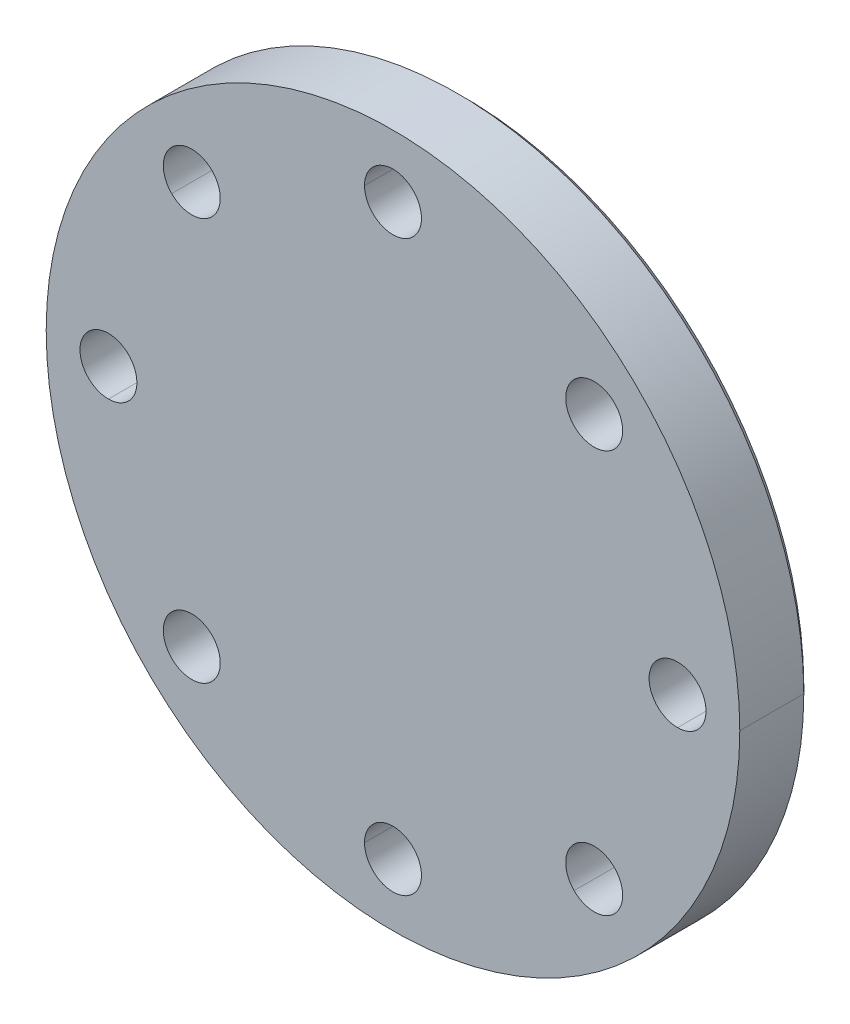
ISO-10303-21;
HEADER;
FILE_DESCRIPTION(('STEP AP214'),'2;1');
FILE_NAME('part.step','',(''),(''),'','','');
FILE_SCHEMA(('AUTOMOTIVE_DESIGN { 1 0 10303 214 1 1 1 1 }'));
ENDSEC;
DATA;
#1=APPLICATION_CONTEXT('core data for automotive mechanical design processes');
#2=APPLICATION_PROTOCOL_DEFINITION('international standard','automotive_design',2000,#1);
#3=PRODUCT_CONTEXT('',#1,'mechanical');
#4=PRODUCT('Part','Part','',(#3));
#5=PRODUCT_RELATED_PRODUCT_CATEGORY('part','',(#4));
#6=PRODUCT_DEFINITION_FORMATION('','',#4);
#7=PRODUCT_DEFINITION_CONTEXT('part definition',#1,'design');
#8=PRODUCT_DEFINITION('design','',#6,#7);
#9=PRODUCT_DEFINITION_SHAPE('','',#8);
#10=(LENGTH_UNIT() NAMED_UNIT(*) SI_UNIT(.MILLI.,.METRE.));
#11=(NAMED_UNIT(*) PLANE_ANGLE_UNIT() SI_UNIT($,.RADIAN.));
#12=(NAMED_UNIT(*) SI_UNIT($,.STERADIAN.) SOLID_ANGLE_UNIT());
#13=UNCERTAINTY_MEASURE_WITH_UNIT(LENGTH_MEASURE(1.E-05),#10,'distance_accuracy_value','');
#14=(GEOMETRIC_REPRESENTATION_CONTEXT(3) GLOBAL_UNCERTAINTY_ASSIGNED_CONTEXT((#13)) GLOBAL_UNIT_ASSIGNED_CONTEXT((#10,
#11,#12)) REPRESENTATION_CONTEXT('',''));
#15=CARTESIAN_POINT('',(0.,0.,0.));
#16=DIRECTION('',(0.,0.,1.));
#17=DIRECTION('',(1.,0.,0.));
#18=AXIS2_PLACEMENT_3D('',#15,#16,#17);
#19=CARTESIAN_POINT('',(3.5,9.45,-17.));
#20=DIRECTION('',(0.,0.,-1.));
#21=DIRECTION('',(-1.,0.,0.));
#22=AXIS2_PLACEMENT_3D('',#19,#20,#21);
#23=PLANE('',#22);
#24=CARTESIAN_POINT('',(0.,0.,-17.));
#25=DIRECTION('',(0.,0.,-1.));
#26=DIRECTION('',(-0.579487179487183,-0.814981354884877,0.));
#27=AXIS2_PLACEMENT_3D('',#24,#25,#26);
#28=CIRCLE('',#27,9.75);
#29=CARTESIAN_POINT('',(9.75,0.,-17.));
#30=VERTEX_POINT('',#29);
#31=CARTESIAN_POINT('',(-9.75,0.,-17.));
#32=VERTEX_POINT('',#31);
#33=EDGE_CURVE('E11',#30,#32,#28,.T.);
#34=ORIENTED_EDGE('',*,*,#33,.F.);
#35=CARTESIAN_POINT('',(0.,0.,-17.));
#36=DIRECTION('',(0.,0.,-1.));
#37=DIRECTION('',(-1.,0.,0.));
#38=AXIS2_PLACEMENT_3D('',#35,#36,#37);
#39=CIRCLE('',#38,9.75);
#40=EDGE_CURVE('E58',#32,#30,#39,.T.);
#41=ORIENTED_EDGE('',*,*,#40,.F.);
#42=EDGE_LOOP('',(#34,#41));
#43=FACE_BOUND('',#42,.T.);
#44=CARTESIAN_POINT('',(0.,8.,-17.));
#45=DIRECTION('',(0.,0.,1.));
#46=DIRECTION('',(1.,0.,0.));
#47=AXIS2_PLACEMENT_3D('',#44,#45,#46);
#48=CIRCLE('',#47,0.8);
#49=CARTESIAN_POINT('',(0.8,8.,-17.));
#50=VERTEX_POINT('',#49);
#51=CARTESIAN_POINT('',(-0.8,8.,-17.));
#52=VERTEX_POINT('',#51);
#53=EDGE_CURVE('E438',#50,#52,#48,.T.);
#54=ORIENTED_EDGE('',*,*,#53,.F.);
#55=CARTESIAN_POINT('',(0.,8.,-17.));
#56=DIRECTION('',(0.,0.,-1.));
#57=DIRECTION('',(1.,0.,0.));
#58=AXIS2_PLACEMENT_3D('',#55,#56,#57);
#59=CIRCLE('',#58,0.8);
#60=EDGE_CURVE('E51',#50,#52,#59,.T.);
#61=ORIENTED_EDGE('',*,*,#60,.T.);
#62=EDGE_LOOP('',(#54,#61));
#63=FACE_BOUND('',#62,.T.);
#64=CARTESIAN_POINT('',(5.656854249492,5.656854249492,-17.));
#65=DIRECTION('',(0.,0.,1.));
#66=DIRECTION('',(0.707106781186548,-0.707106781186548,0.));
#67=AXIS2_PLACEMENT_3D('',#64,#65,#66);
#68=CIRCLE('',#67,0.8);
#69=CARTESIAN_POINT('',(6.222539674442,5.091168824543,-17.));
#70=VERTEX_POINT('',#69);
#71=CARTESIAN_POINT('',(5.091168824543,6.222539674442,-17.));
#72=VERTEX_POINT('',#71);
#73=EDGE_CURVE('E387',#70,#72,#68,.T.);
#74=ORIENTED_EDGE('',*,*,#73,.F.);
#75=CARTESIAN_POINT('',(5.656854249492,5.656854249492,-17.));
#76=DIRECTION('',(0.,0.,-1.));
#77=DIRECTION('',(0.707106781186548,-0.707106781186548,0.));
#78=AXIS2_PLACEMENT_3D('',#75,#76,#77);
#79=CIRCLE('',#78,0.8);
#80=EDGE_CURVE('E428',#70,#72,#79,.T.);
#81=ORIENTED_EDGE('',*,*,#80,.T.);
#82=EDGE_LOOP('',(#74,#81));
#83=FACE_BOUND('',#82,.T.);
#84=CARTESIAN_POINT('',(8.,0.,-17.));
#85=DIRECTION('',(0.,0.,1.));
#86=DIRECTION('',(0.,-1.,0.));
#87=AXIS2_PLACEMENT_3D('',#84,#85,#86);
#88=CIRCLE('',#87,0.8);
#89=CARTESIAN_POINT('',(8.,-0.8,-17.));
#90=VERTEX_POINT('',#89);
#91=CARTESIAN_POINT('',(8.,0.8,-17.));
#92=VERTEX_POINT('',#91);
#93=EDGE_CURVE('E398',#90,#92,#88,.T.);
#94=ORIENTED_EDGE('',*,*,#93,.F.);
#95=CARTESIAN_POINT('',(8.,0.,-17.));
#96=DIRECTION('',(0.,0.,-1.));
#97=DIRECTION('',(0.,-1.,0.));
#98=AXIS2_PLACEMENT_3D('',#95,#96,#97);
#99=CIRCLE('',#98,0.8);
#100=EDGE_CURVE('E426',#90,#92,#99,.T.);
#101=ORIENTED_EDGE('',*,*,#100,.T.);
#102=EDGE_LOOP('',(#94,#101));
#103=FACE_BOUND('',#102,.T.);
#104=CARTESIAN_POINT('',(5.656854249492,-5.656854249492,-17.));
#105=DIRECTION('',(0.,0.,1.));
#106=DIRECTION('',(-0.707106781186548,-0.707106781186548,0.));
#107=AXIS2_PLACEMENT_3D('',#104,#105,#106);
#108=CIRCLE('',#107,0.8);
#109=CARTESIAN_POINT('',(5.091168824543,-6.222539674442,-17.));
#110=VERTEX_POINT('',#109);
#111=CARTESIAN_POINT('',(6.222539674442,-5.091168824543,-17.));
#112=VERTEX_POINT('',#111);
#113=EDGE_CURVE('E381',#110,#112,#108,.T.);
#114=ORIENTED_EDGE('',*,*,#113,.F.);
#115=CARTESIAN_POINT('',(5.656854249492,-5.656854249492,-17.));
#116=DIRECTION('',(0.,0.,-1.));
#117=DIRECTION('',(-0.707106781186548,-0.707106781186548,0.));
#118=AXIS2_PLACEMENT_3D('',#115,#116,#117);
#119=CIRCLE('',#118,0.8);
#120=EDGE_CURVE('E423',#110,#112,#119,.T.);
#121=ORIENTED_EDGE('',*,*,#120,.T.);
#122=EDGE_LOOP('',(#114,#121));
#123=FACE_BOUND('',#122,.T.);
#124=CARTESIAN_POINT('',(0.,-8.,-17.));
#125=DIRECTION('',(0.,0.,1.));
#126=DIRECTION('',(-1.,0.,0.));
#127=AXIS2_PLACEMENT_3D('',#124,#125,#126);
#128=CIRCLE('',#127,0.8);
#129=CARTESIAN_POINT('',(-0.8,-8.,-17.));
#130=VERTEX_POINT('',#129);
#131=CARTESIAN_POINT('',(0.8,-8.,-17.));
#132=VERTEX_POINT('',#131);
#133=EDGE_CURVE('E404',#130,#132,#128,.T.);
#134=ORIENTED_EDGE('',*,*,#133,.F.);
#135=CARTESIAN_POINT('',(0.,-8.,-17.));
#136=DIRECTION('',(0.,0.,-1.));
#137=DIRECTION('',(-1.,0.,0.));
#138=AXIS2_PLACEMENT_3D('',#135,#136,#137);
#139=CIRCLE('',#138,0.8);
#140=EDGE_CURVE('E420',#130,#132,#139,.T.);
#141=ORIENTED_EDGE('',*,*,#140,.T.);
#142=EDGE_LOOP('',(#134,#141));
#143=FACE_BOUND('',#142,.T.);
#144=CARTESIAN_POINT('',(-5.656854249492,-5.656854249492,-17.));
#145=DIRECTION('',(0.,0.,1.));
#146=DIRECTION('',(-0.707106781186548,0.707106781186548,0.));
#147=AXIS2_PLACEMENT_3D('',#144,#145,#146);
#148=CIRCLE('',#147,0.8);
#149=CARTESIAN_POINT('',(-6.222539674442,-5.091168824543,-17.));
#150=VERTEX_POINT('',#149);
#151=CARTESIAN_POINT('',(-5.091168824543,-6.222539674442,-17.));
#152=VERTEX_POINT('',#151);
#153=EDGE_CURVE('E569',#150,#152,#148,.T.);
#154=ORIENTED_EDGE('',*,*,#153,.F.);
#155=CARTESIAN_POINT('',(-5.656854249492,-5.656854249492,-17.));
#156=DIRECTION('',(0.,0.,-1.));
#157=DIRECTION('',(-0.707106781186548,0.707106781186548,0.));
#158=AXIS2_PLACEMENT_3D('',#155,#156,#157);
#159=CIRCLE('',#158,0.8);
#160=EDGE_CURVE('E417',#150,#152,#159,.T.);
#161=ORIENTED_EDGE('',*,*,#160,.T.);
#162=EDGE_LOOP('',(#154,#161));
#163=FACE_BOUND('',#162,.T.);
#164=CARTESIAN_POINT('',(-8.,0.,-17.));
#165=DIRECTION('',(0.,0.,1.));
#166=DIRECTION('',(0.,1.,0.));
#167=AXIS2_PLACEMENT_3D('',#164,#165,#166);
#168=CIRCLE('',#167,0.8);
#169=CARTESIAN_POINT('',(-8.,0.8,-17.));
#170=VERTEX_POINT('',#169);
#171=CARTESIAN_POINT('',(-8.,-0.8,-17.));
#172=VERTEX_POINT('',#171);
#173=EDGE_CURVE('E482',#170,#172,#168,.T.);
#174=ORIENTED_EDGE('',*,*,#173,.F.);
#175=CARTESIAN_POINT('',(-8.,0.,-17.));
#176=DIRECTION('',(0.,0.,-1.));
#177=DIRECTION('',(0.,1.,0.));
#178=AXIS2_PLACEMENT_3D('',#175,#176,#177);
#179=CIRCLE('',#178,0.8);
#180=EDGE_CURVE('E242',#170,#172,#179,.T.);
#181=ORIENTED_EDGE('',*,*,#180,.T.);
#182=EDGE_LOOP('',(#174,#181));
#183=FACE_BOUND('',#182,.T.);
#184=CARTESIAN_POINT('',(-5.656854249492,5.656854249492,-17.));
#185=DIRECTION('',(0.,0.,1.));
#186=DIRECTION('',(0.707106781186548,0.707106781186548,0.));
#187=AXIS2_PLACEMENT_3D('',#184,#185,#186);
#188=CIRCLE('',#187,0.8);
#189=CARTESIAN_POINT('',(-5.091168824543,6.222539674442,-17.));
#190=VERTEX_POINT('',#189);
#191=CARTESIAN_POINT('',(-6.222539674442,5.091168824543,-17.));
#192=VERTEX_POINT('',#191);
#193=EDGE_CURVE('E355',#190,#192,#188,.T.);
#194=ORIENTED_EDGE('',*,*,#193,.F.);
#195=CARTESIAN_POINT('',(-5.656854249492,5.656854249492,-17.));
#196=DIRECTION('',(0.,0.,-1.));
#197=DIRECTION('',(0.707106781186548,0.707106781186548,0.));
#198=AXIS2_PLACEMENT_3D('',#195,#196,#197);
#199=CIRCLE('',#198,0.8);
#200=EDGE_CURVE('E305',#190,#192,#199,.T.);
#201=ORIENTED_EDGE('',*,*,#200,.T.);
#202=EDGE_LOOP('',(#194,#201));
#203=FACE_BOUND('',#202,.T.);
#204=ADVANCED_FACE('F47',(#43,#63,#83,#103,#123,#143,#163,#183,#203),#23,.F.);
#205=CARTESIAN_POINT('',(0.,0.,-18.5));
#206=DIRECTION('',(0.,0.,-1.));
#207=DIRECTION('',(0.,-1.,0.));
#208=AXIS2_PLACEMENT_3D('',#205,#206,#207);
#209=PLANE('',#208);
#210=CARTESIAN_POINT('',(0.,0.,-18.5));
#211=DIRECTION('',(0.,0.,-1.));
#212=DIRECTION('',(1.,0.,0.));
#213=AXIS2_PLACEMENT_3D('',#210,#211,#212);
#214=CIRCLE('',#213,6.1);
#215=CARTESIAN_POINT('',(6.1,0.,-18.5));
#216=VERTEX_POINT('',#215);
#217=CARTESIAN_POINT('',(-6.1,0.,-18.5));
#218=VERTEX_POINT('',#217);
#219=EDGE_CURVE('E489',#216,#218,#214,.T.);
#220=ORIENTED_EDGE('',*,*,#219,.T.);
#221=CARTESIAN_POINT('',(0.,0.,-18.5));
#222=DIRECTION('',(0.,0.,-1.));
#223=DIRECTION('',(-1.,0.,0.));
#224=AXIS2_PLACEMENT_3D('',#221,#222,#223);
#225=CIRCLE('',#224,6.1);
#226=EDGE_CURVE('E375',#218,#216,#225,.T.);
#227=ORIENTED_EDGE('',*,*,#226,.T.);
#228=EDGE_LOOP('',(#220,#227));
#229=FACE_BOUND('',#228,.T.);
#230=ADVANCED_FACE('F646',(#229),#209,.T.);
#231=CARTESIAN_POINT('',(0.,0.,-19.));
#232=DIRECTION('',(0.,0.,-1.));
#233=DIRECTION('',(-1.,0.,0.));
#234=AXIS2_PLACEMENT_3D('',#231,#232,#233);
#235=CYLINDRICAL_SURFACE('',#234,6.1);
#236=DIRECTION('',(0.,0.,1.));
#237=VECTOR('',#236,1.);
#238=CARTESIAN_POINT('',(6.1,0.,-19.));
#239=LINE('',#238,#237);
#240=CARTESIAN_POINT('',(6.1,0.,-19.));
#241=VERTEX_POINT('',#240);
#242=EDGE_CURVE('E370',#241,#216,#239,.T.);
#243=ORIENTED_EDGE('',*,*,#242,.T.);
#244=ORIENTED_EDGE('',*,*,#226,.F.);
#245=DIRECTION('',(0.,0.,1.));
#246=VECTOR('',#245,1.);
#247=CARTESIAN_POINT('',(-6.1,0.,-19.));
#248=LINE('',#247,#246);
#249=CARTESIAN_POINT('',(-6.1,0.,-19.));
#250=VERTEX_POINT('',#249);
#251=EDGE_CURVE('E524',#250,#218,#248,.T.);
#252=ORIENTED_EDGE('',*,*,#251,.F.);
#253=CARTESIAN_POINT('',(0.,0.,-19.));
#254=DIRECTION('',(0.,0.,-1.));
#255=DIRECTION('',(-1.,0.,0.));
#256=AXIS2_PLACEMENT_3D('',#253,#254,#255);
#257=CIRCLE('',#256,6.1);
#258=EDGE_CURVE('E374',#250,#241,#257,.T.);
#259=ORIENTED_EDGE('',*,*,#258,.T.);
#260=EDGE_LOOP('',(#243,#244,#252,#259));
#261=FACE_BOUND('',#260,.T.);
#262=ADVANCED_FACE('F652',(#261),#235,.F.);
#263=CARTESIAN_POINT('',(0.,0.,-19.));
#264=DIRECTION('',(0.,0.,-1.));
#265=DIRECTION('',(-1.,0.,0.));
#266=AXIS2_PLACEMENT_3D('',#263,#264,#265);
#267=CYLINDRICAL_SURFACE('',#266,6.1);
#268=ORIENTED_EDGE('',*,*,#251,.T.);
#269=ORIENTED_EDGE('',*,*,#219,.F.);
#270=ORIENTED_EDGE('',*,*,#242,.F.);
#271=CARTESIAN_POINT('',(0.,0.,-19.));
#272=DIRECTION('',(0.,0.,-1.));
#273=DIRECTION('',(1.,0.,0.));
#274=AXIS2_PLACEMENT_3D('',#271,#272,#273);
#275=CIRCLE('',#274,6.1);
#276=EDGE_CURVE('E481',#241,#250,#275,.T.);
#277=ORIENTED_EDGE('',*,*,#276,.T.);
#278=EDGE_LOOP('',(#268,#269,#270,#277));
#279=FACE_BOUND('',#278,.T.);
#280=ADVANCED_FACE('F715',(#279),#267,.F.);
#281=CARTESIAN_POINT('',(0.,0.,-19.));
#282=DIRECTION('',(0.,0.,-1.));
#283=DIRECTION('',(0.,-1.,0.));
#284=AXIS2_PLACEMENT_3D('',#281,#282,#283);
#285=PLANE('',#284);
#286=ORIENTED_EDGE('',*,*,#276,.F.);
#287=ORIENTED_EDGE('',*,*,#258,.F.);
#288=EDGE_LOOP('',(#286,#287));
#289=FACE_BOUND('',#288,.T.);
#290=CARTESIAN_POINT('',(-5.656854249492,5.656854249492,-19.));
#291=DIRECTION('',(0.,0.,-1.));
#292=DIRECTION('',(-0.707106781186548,-0.707106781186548,0.));
#293=AXIS2_PLACEMENT_3D('',#290,#291,#292);
#294=CIRCLE('',#293,1.1);
#295=CARTESIAN_POINT('',(-6.434671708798,4.879036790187,-19.));
#296=VERTEX_POINT('',#295);
#297=CARTESIAN_POINT('',(-4.879036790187,6.434671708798,-19.));
#298=VERTEX_POINT('',#297);
#299=EDGE_CURVE('E480',#296,#298,#294,.T.);
#300=ORIENTED_EDGE('',*,*,#299,.F.);
#301=CARTESIAN_POINT('',(-5.656854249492,5.656854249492,-19.));
#302=DIRECTION('',(0.,0.,-1.));
#303=DIRECTION('',(0.707106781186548,0.707106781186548,0.));
#304=AXIS2_PLACEMENT_3D('',#301,#302,#303);
#305=CIRCLE('',#304,1.1);
#306=EDGE_CURVE('E477',#298,#296,#305,.T.);
#307=ORIENTED_EDGE('',*,*,#306,.F.);
#308=EDGE_LOOP('',(#300,#307));
#309=FACE_BOUND('',#308,.T.);
#310=CARTESIAN_POINT('',(-8.,0.,-19.));
#311=DIRECTION('',(0.,0.,-1.));
#312=DIRECTION('',(0.,-1.,0.));
#313=AXIS2_PLACEMENT_3D('',#310,#311,#312);
#314=CIRCLE('',#313,1.1);
#315=CARTESIAN_POINT('',(-8.,-1.1,-19.));
#316=VERTEX_POINT('',#315);
#317=CARTESIAN_POINT('',(-8.,1.1,-19.));
#318=VERTEX_POINT('',#317);
#319=EDGE_CURVE('E523',#316,#318,#314,.T.);
#320=ORIENTED_EDGE('',*,*,#319,.F.);
#321=CARTESIAN_POINT('',(-8.,0.,-19.));
#322=DIRECTION('',(0.,0.,-1.));
#323=DIRECTION('',(0.,1.,0.));
#324=AXIS2_PLACEMENT_3D('',#321,#322,#323);
#325=CIRCLE('',#324,1.1);
#326=EDGE_CURVE('E499',#318,#316,#325,.T.);
#327=ORIENTED_EDGE('',*,*,#326,.F.);
#328=EDGE_LOOP('',(#320,#327));
#329=FACE_BOUND('',#328,.T.);
#330=CARTESIAN_POINT('',(-5.656854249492,-5.656854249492,-19.));
#331=DIRECTION('',(0.,0.,-1.));
#332=DIRECTION('',(0.707106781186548,-0.707106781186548,0.));
#333=AXIS2_PLACEMENT_3D('',#330,#331,#332);
#334=CIRCLE('',#333,1.1);
#335=CARTESIAN_POINT('',(-4.879036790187,-6.434671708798,-19.));
#336=VERTEX_POINT('',#335);
#337=CARTESIAN_POINT('',(-6.434671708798,-4.879036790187,-19.));
#338=VERTEX_POINT('',#337);
#339=EDGE_CURVE('E339',#336,#338,#334,.T.);
#340=ORIENTED_EDGE('',*,*,#339,.F.);
#341=CARTESIAN_POINT('',(-5.656854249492,-5.656854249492,-19.));
#342=DIRECTION('',(0.,0.,-1.));
#343=DIRECTION('',(-0.707106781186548,0.707106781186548,0.));
#344=AXIS2_PLACEMENT_3D('',#341,#342,#343);
#345=CIRCLE('',#344,1.1);
#346=EDGE_CURVE('E519',#338,#336,#345,.T.);
#347=ORIENTED_EDGE('',*,*,#346,.F.);
#348=EDGE_LOOP('',(#340,#347));
#349=FACE_BOUND('',#348,.T.);
#350=CARTESIAN_POINT('',(0.,-8.,-19.));
#351=DIRECTION('',(0.,0.,-1.));
#352=DIRECTION('',(1.,0.,0.));
#353=AXIS2_PLACEMENT_3D('',#350,#351,#352);
#354=CIRCLE('',#353,1.1);
#355=CARTESIAN_POINT('',(1.1,-8.,-19.));
#356=VERTEX_POINT('',#355);
#357=CARTESIAN_POINT('',(-1.1,-8.,-19.));
#358=VERTEX_POINT('',#357);
#359=EDGE_CURVE('E323',#356,#358,#354,.T.);
#360=ORIENTED_EDGE('',*,*,#359,.F.);
#361=CARTESIAN_POINT('',(0.,-8.,-19.));
#362=DIRECTION('',(0.,0.,-1.));
#363=DIRECTION('',(-1.,0.,0.));
#364=AXIS2_PLACEMENT_3D('',#361,#362,#363);
#365=CIRCLE('',#364,1.1);
#366=EDGE_CURVE('E334',#358,#356,#365,.T.);
#367=ORIENTED_EDGE('',*,*,#366,.F.);
#368=EDGE_LOOP('',(#360,#367));
#369=FACE_BOUND('',#368,.T.);
#370=CARTESIAN_POINT('',(5.656854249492,-5.656854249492,-19.));
#371=DIRECTION('',(0.,0.,-1.));
#372=DIRECTION('',(0.707106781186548,0.707106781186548,0.));
#373=AXIS2_PLACEMENT_3D('',#370,#371,#372);
#374=CIRCLE('',#373,1.1);
#375=CARTESIAN_POINT('',(6.434671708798,-4.879036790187,-19.));
#376=VERTEX_POINT('',#375);
#377=CARTESIAN_POINT('',(4.879036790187,-6.434671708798,-19.));
#378=VERTEX_POINT('',#377);
#379=EDGE_CURVE('E349',#376,#378,#374,.T.);
#380=ORIENTED_EDGE('',*,*,#379,.F.);
#381=CARTESIAN_POINT('',(5.656854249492,-5.656854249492,-19.));
#382=DIRECTION('',(0.,0.,-1.));
#383=DIRECTION('',(-0.707106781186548,-0.707106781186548,0.));
#384=AXIS2_PLACEMENT_3D('',#381,#382,#383);
#385=CIRCLE('',#384,1.1);
#386=EDGE_CURVE('E344',#378,#376,#385,.T.);
#387=ORIENTED_EDGE('',*,*,#386,.F.);
#388=EDGE_LOOP('',(#380,#387));
#389=FACE_BOUND('',#388,.T.);
#390=CARTESIAN_POINT('',(8.,0.,-19.));
#391=DIRECTION('',(0.,0.,-1.));
#392=DIRECTION('',(0.,1.,0.));
#393=AXIS2_PLACEMENT_3D('',#390,#391,#392);
#394=CIRCLE('',#393,1.1);
#395=CARTESIAN_POINT('',(8.,1.1,-19.));
#396=VERTEX_POINT('',#395);
#397=CARTESIAN_POINT('',(8.,-1.1,-19.));
#398=VERTEX_POINT('',#397);
#399=EDGE_CURVE('E599',#396,#398,#394,.T.);
#400=ORIENTED_EDGE('',*,*,#399,.F.);
#401=CARTESIAN_POINT('',(8.,0.,-19.));
#402=DIRECTION('',(0.,0.,-1.));
#403=DIRECTION('',(0.,-1.,0.));
#404=AXIS2_PLACEMENT_3D('',#401,#402,#403);
#405=CIRCLE('',#404,1.1);
#406=EDGE_CURVE('E603',#398,#396,#405,.T.);
#407=ORIENTED_EDGE('',*,*,#406,.F.);
#408=EDGE_LOOP('',(#400,#407));
#409=FACE_BOUND('',#408,.T.);
#410=CARTESIAN_POINT('',(5.656854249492,5.656854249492,-19.));
#411=DIRECTION('',(0.,0.,-1.));
#412=DIRECTION('',(-0.707106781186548,0.707106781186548,0.));
#413=AXIS2_PLACEMENT_3D('',#410,#411,#412);
#414=CIRCLE('',#413,1.1);
#415=CARTESIAN_POINT('',(4.879036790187,6.434671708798,-19.));
#416=VERTEX_POINT('',#415);
#417=CARTESIAN_POINT('',(6.434671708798,4.879036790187,-19.));
#418=VERTEX_POINT('',#417);
#419=EDGE_CURVE('E549',#416,#418,#414,.T.);
#420=ORIENTED_EDGE('',*,*,#419,.F.);
#421=CARTESIAN_POINT('',(5.656854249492,5.656854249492,-19.));
#422=DIRECTION('',(0.,0.,-1.));
#423=DIRECTION('',(0.707106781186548,-0.707106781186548,0.));
#424=AXIS2_PLACEMENT_3D('',#421,#422,#423);
#425=CIRCLE('',#424,1.1);
#426=EDGE_CURVE('E576',#418,#416,#425,.T.);
#427=ORIENTED_EDGE('',*,*,#426,.F.);
#428=EDGE_LOOP('',(#420,#427));
#429=FACE_BOUND('',#428,.T.);
#430=CARTESIAN_POINT('',(0.,8.,-19.));
#431=DIRECTION('',(0.,0.,-1.));
#432=DIRECTION('',(-1.,0.,0.));
#433=AXIS2_PLACEMENT_3D('',#430,#431,#432);
#434=CIRCLE('',#433,1.1);
#435=CARTESIAN_POINT('',(-1.1,8.,-19.));
#436=VERTEX_POINT('',#435);
#437=CARTESIAN_POINT('',(1.1,8.,-19.));
#438=VERTEX_POINT('',#437);
#439=EDGE_CURVE('E540',#436,#438,#434,.T.);
#440=ORIENTED_EDGE('',*,*,#439,.F.);
#441=CARTESIAN_POINT('',(0.,8.,-19.));
#442=DIRECTION('',(0.,0.,-1.));
#443=DIRECTION('',(1.,0.,0.));
#444=AXIS2_PLACEMENT_3D('',#441,#442,#443);
#445=CIRCLE('',#444,1.1);
#446=EDGE_CURVE('E545',#438,#436,#445,.T.);
#447=ORIENTED_EDGE('',*,*,#446,.F.);
#448=EDGE_LOOP('',(#440,#447));
#449=FACE_BOUND('',#448,.T.);
#450=CARTESIAN_POINT('',(0.,0.,-19.));
#451=DIRECTION('',(0.,0.,-1.));
#452=DIRECTION('',(-1.,0.,0.));
#453=AXIS2_PLACEMENT_3D('',#450,#451,#452);
#454=CIRCLE('',#453,9.55);
#455=CARTESIAN_POINT('',(-9.55,0.,-19.));
#456=VERTEX_POINT('',#455);
#457=CARTESIAN_POINT('',(9.55,0.,-19.));
#458=VERTEX_POINT('',#457);
#459=EDGE_CURVE('E544',#456,#458,#454,.T.);
#460=ORIENTED_EDGE('',*,*,#459,.T.);
#461=CARTESIAN_POINT('',(0.,0.,-19.));
#462=DIRECTION('',(0.,0.,-1.));
#463=DIRECTION('',(1.,0.,0.));
#464=AXIS2_PLACEMENT_3D('',#461,#462,#463);
#465=CIRCLE('',#464,9.55);
#466=EDGE_CURVE('E396',#458,#456,#465,.T.);
#467=ORIENTED_EDGE('',*,*,#466,.T.);
#468=EDGE_LOOP('',(#460,#467));
#469=FACE_BOUND('',#468,.T.);
#470=ADVANCED_FACE('F341',(#289,#309,#329,#349,#369,#389,#409,#429,#449,#469),#285,.T.);
#471=CARTESIAN_POINT('',(0.,0.,-18.90000000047));
#472=DIRECTION('',(0.,0.,1.));
#473=DIRECTION('',(0.,-1.,0.));
#474=AXIS2_PLACEMENT_3D('',#471,#472,#473);
#475=CONICAL_SURFACE('',#474,9.649999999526,0.7853981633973);
#476=DIRECTION('',(0.707106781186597,3.75992164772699E-09,0.707106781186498));
#477=VECTOR('',#476,1.);
#478=CARTESIAN_POINT('',(9.549999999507,-4.539043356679E-09,-19.00000000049));
#479=LINE('',#478,#477);
#480=CARTESIAN_POINT('',(9.75,0.,-18.8));
#481=VERTEX_POINT('',#480);
#482=EDGE_CURVE('E395',#458,#481,#479,.T.);
#483=ORIENTED_EDGE('',*,*,#482,.T.);
#484=CARTESIAN_POINT('',(0.,0.,-18.8));
#485=DIRECTION('',(0.,0.,-1.));
#486=DIRECTION('',(1.,0.,0.));
#487=AXIS2_PLACEMENT_3D('',#484,#485,#486);
#488=CIRCLE('',#487,9.75);
#489=CARTESIAN_POINT('',(-9.75,0.,-18.8));
#490=VERTEX_POINT('',#489);
#491=EDGE_CURVE('E561',#481,#490,#488,.T.);
#492=ORIENTED_EDGE('',*,*,#491,.T.);
#493=DIRECTION('',(-0.707106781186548,-3.75993089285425E-09,0.707106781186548));
#494=VECTOR('',#493,1.);
#495=CARTESIAN_POINT('',(-9.549999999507,4.539047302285E-09,-19.00000000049));
#496=LINE('',#495,#494);
#497=EDGE_CURVE('E393',#456,#490,#496,.T.);
#498=ORIENTED_EDGE('',*,*,#497,.F.);
#499=ORIENTED_EDGE('',*,*,#466,.F.);
#500=EDGE_LOOP('',(#483,#492,#498,#499));
#501=FACE_BOUND('',#500,.T.);
#502=ADVANCED_FACE('F629',(#501),#475,.T.);
#503=CARTESIAN_POINT('',(0.,0.,-18.90000000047));
#504=DIRECTION('',(0.,0.,1.));
#505=DIRECTION('',(0.,-1.,0.));
#506=AXIS2_PLACEMENT_3D('',#503,#504,#505);
#507=CONICAL_SURFACE('',#506,9.649999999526,0.7853981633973);
#508=ORIENTED_EDGE('',*,*,#497,.T.);
#509=CARTESIAN_POINT('',(0.,0.,-18.8));
#510=DIRECTION('',(0.,0.,-1.));
#511=DIRECTION('',(-1.,0.,0.));
#512=AXIS2_PLACEMENT_3D('',#509,#510,#511);
#513=CIRCLE('',#512,9.75);
#514=EDGE_CURVE('E556',#490,#481,#513,.T.);
#515=ORIENTED_EDGE('',*,*,#514,.T.);
#516=ORIENTED_EDGE('',*,*,#482,.F.);
#517=ORIENTED_EDGE('',*,*,#459,.F.);
#518=EDGE_LOOP('',(#508,#515,#516,#517));
#519=FACE_BOUND('',#518,.T.);
#520=ADVANCED_FACE('F637',(#519),#507,.T.);
#521=CARTESIAN_POINT('',(0.,0.,-16.));
#522=DIRECTION('',(0.,0.,-1.));
#523=DIRECTION('',(-1.,0.,0.));
#524=AXIS2_PLACEMENT_3D('',#521,#522,#523);
#525=CYLINDRICAL_SURFACE('',#524,9.75);
#526=DIRECTION('',(-2.096841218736E-10,-1.930876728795E-09,-1.));
#527=VECTOR('',#526,1.);
#528=CARTESIAN_POINT('',(9.75,0.,-17.));
#529=LINE('',#528,#527);
#530=EDGE_CURVE('E552',#30,#481,#529,.T.);
#531=ORIENTED_EDGE('',*,*,#530,.F.);
#532=ORIENTED_EDGE('',*,*,#33,.T.);
#533=DIRECTION('',(2.096841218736E-10,1.930877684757E-09,-1.));
#534=VECTOR('',#533,1.);
#535=CARTESIAN_POINT('',(-9.75,0.,-17.));
#536=LINE('',#535,#534);
#537=EDGE_CURVE('E565',#32,#490,#536,.T.);
#538=ORIENTED_EDGE('',*,*,#537,.T.);
#539=ORIENTED_EDGE('',*,*,#491,.F.);
#540=EDGE_LOOP('',(#531,#532,#538,#539));
#541=FACE_BOUND('',#540,.T.);
#542=ADVANCED_FACE('F634',(#541),#525,.T.);
#543=CARTESIAN_POINT('',(0.,0.,-16.));
#544=DIRECTION('',(0.,0.,-1.));
#545=DIRECTION('',(-1.,0.,0.));
#546=AXIS2_PLACEMENT_3D('',#543,#544,#545);
#547=CYLINDRICAL_SURFACE('',#546,9.75);
#548=ORIENTED_EDGE('',*,*,#40,.T.);
#549=ORIENTED_EDGE('',*,*,#530,.T.);
#550=ORIENTED_EDGE('',*,*,#514,.F.);
#551=ORIENTED_EDGE('',*,*,#537,.F.);
#552=EDGE_LOOP('',(#548,#549,#550,#551));
#553=FACE_BOUND('',#552,.T.);
#554=ADVANCED_FACE('F641',(#553),#547,.T.);
#555=CARTESIAN_POINT('',(0.,8.,-18.85));
#556=DIRECTION('',(0.,0.,-1.));
#557=DIRECTION('',(1.,0.,0.));
#558=AXIS2_PLACEMENT_3D('',#555,#556,#557);
#559=CONICAL_SURFACE('',#558,0.95,0.7853981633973);
#560=DIRECTION('',(-0.707106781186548,0.,-0.707106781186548));
#561=VECTOR('',#560,1.);
#562=CARTESIAN_POINT('',(-0.8,8.,-18.7));
#563=LINE('',#562,#561);
#564=CARTESIAN_POINT('',(-0.8,8.,-18.7));
#565=VERTEX_POINT('',#564);
#566=EDGE_CURVE('E486',#565,#436,#563,.T.);
#567=ORIENTED_EDGE('',*,*,#566,.F.);
#568=CARTESIAN_POINT('',(0.,8.,-18.7));
#569=DIRECTION('',(0.,0.,-1.));
#570=DIRECTION('',(1.,0.,0.));
#571=AXIS2_PLACEMENT_3D('',#568,#569,#570);
#572=CIRCLE('',#571,0.8);
#573=CARTESIAN_POINT('',(0.8,8.,-18.7));
#574=VERTEX_POINT('',#573);
#575=EDGE_CURVE('E454',#574,#565,#572,.T.);
#576=ORIENTED_EDGE('',*,*,#575,.F.);
#577=DIRECTION('',(0.707106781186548,0.,-0.707106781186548));
#578=VECTOR('',#577,1.);
#579=CARTESIAN_POINT('',(0.8,8.,-18.7));
#580=LINE('',#579,#578);
#581=EDGE_CURVE('E501',#574,#438,#580,.T.);
#582=ORIENTED_EDGE('',*,*,#581,.T.);
#583=ORIENTED_EDGE('',*,*,#446,.T.);
#584=EDGE_LOOP('',(#567,#576,#582,#583));
#585=FACE_BOUND('',#584,.T.);
#586=ADVANCED_FACE('F844',(#585),#559,.F.);
#587=CARTESIAN_POINT('',(0.,8.,-18.85));
#588=DIRECTION('',(0.,0.,-1.));
#589=DIRECTION('',(1.,0.,0.));
#590=AXIS2_PLACEMENT_3D('',#587,#588,#589);
#591=CONICAL_SURFACE('',#590,0.95,0.7853981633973);
#592=ORIENTED_EDGE('',*,*,#581,.F.);
#593=CARTESIAN_POINT('',(0.,8.,-18.7));
#594=DIRECTION('',(0.,0.,1.));
#595=DIRECTION('',(1.,0.,0.));
#596=AXIS2_PLACEMENT_3D('',#593,#594,#595);
#597=CIRCLE('',#596,0.8);
#598=EDGE_CURVE('E450',#574,#565,#597,.T.);
#599=ORIENTED_EDGE('',*,*,#598,.T.);
#600=ORIENTED_EDGE('',*,*,#566,.T.);
#601=ORIENTED_EDGE('',*,*,#439,.T.);
#602=EDGE_LOOP('',(#592,#599,#600,#601));
#603=FACE_BOUND('',#602,.T.);
#604=ADVANCED_FACE('F841',(#603),#591,.F.);
#605=CARTESIAN_POINT('',(0.,8.,-16.39527708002));
#606=DIRECTION('',(0.,0.,-1.));
#607=DIRECTION('',(1.,0.,0.));
#608=AXIS2_PLACEMENT_3D('',#605,#606,#607);
#609=CYLINDRICAL_SURFACE('',#608,0.8);
#610=ORIENTED_EDGE('',*,*,#575,.T.);
#611=DIRECTION('',(0.,0.,-1.));
#612=VECTOR('',#611,1.);
#613=CARTESIAN_POINT('',(-0.8,8.,-17.));
#614=LINE('',#613,#612);
#615=EDGE_CURVE('E446',#52,#565,#614,.T.);
#616=ORIENTED_EDGE('',*,*,#615,.F.);
#617=ORIENTED_EDGE('',*,*,#60,.F.);
#618=DIRECTION('',(0.,0.,-1.));
#619=VECTOR('',#618,1.);
#620=CARTESIAN_POINT('',(0.8,8.,-17.));
#621=LINE('',#620,#619);
#622=EDGE_CURVE('E448',#50,#574,#621,.T.);
#623=ORIENTED_EDGE('',*,*,#622,.T.);
#624=EDGE_LOOP('',(#610,#616,#617,#623));
#625=FACE_BOUND('',#624,.T.);
#626=ADVANCED_FACE('F49',(#625),#609,.F.);
#627=CARTESIAN_POINT('',(0.,8.,-16.39527708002));
#628=DIRECTION('',(0.,0.,-1.));
#629=DIRECTION('',(1.,0.,0.));
#630=AXIS2_PLACEMENT_3D('',#627,#628,#629);
#631=CYLINDRICAL_SURFACE('',#630,0.8);
#632=ORIENTED_EDGE('',*,*,#53,.T.);
#633=ORIENTED_EDGE('',*,*,#615,.T.);
#634=ORIENTED_EDGE('',*,*,#598,.F.);
#635=ORIENTED_EDGE('',*,*,#622,.F.);
#636=EDGE_LOOP('',(#632,#633,#634,#635));
#637=FACE_BOUND('',#636,.T.);
#638=ADVANCED_FACE('F444',(#637),#631,.F.);
#639=CARTESIAN_POINT('',(5.656854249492,5.656854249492,-18.85));
#640=DIRECTION('',(0.,0.,-1.));
#641=DIRECTION('',(0.707106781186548,-0.707106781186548,0.));
#642=AXIS2_PLACEMENT_3D('',#639,#640,#641);
#643=CONICAL_SURFACE('',#642,0.95,0.7853981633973);
#644=DIRECTION('',(-0.500000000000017,0.500000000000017,-0.707106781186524));
#645=VECTOR('',#644,1.);
#646=CARTESIAN_POINT('',(5.091168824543,6.222539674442,-18.7));
#647=LINE('',#646,#645);
#648=CARTESIAN_POINT('',(5.091168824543,6.222539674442,-18.7));
#649=VERTEX_POINT('',#648);
#650=EDGE_CURVE('E460',#649,#416,#647,.T.);
#651=ORIENTED_EDGE('',*,*,#650,.F.);
#652=CARTESIAN_POINT('',(5.656854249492,5.656854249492,-18.7));
#653=DIRECTION('',(0.,0.,-1.));
#654=DIRECTION('',(0.707106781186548,-0.707106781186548,0.));
#655=AXIS2_PLACEMENT_3D('',#652,#653,#654);
#656=CIRCLE('',#655,0.8);
#657=CARTESIAN_POINT('',(6.222539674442,5.091168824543,-18.7));
#658=VERTEX_POINT('',#657);
#659=EDGE_CURVE('E492',#658,#649,#656,.T.);
#660=ORIENTED_EDGE('',*,*,#659,.F.);
#661=DIRECTION('',(0.500000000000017,-0.500000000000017,-0.707106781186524));
#662=VECTOR('',#661,1.);
#663=CARTESIAN_POINT('',(6.222539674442,5.091168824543,-18.7));
#664=LINE('',#663,#662);
#665=EDGE_CURVE('E539',#658,#418,#664,.T.);
#666=ORIENTED_EDGE('',*,*,#665,.T.);
#667=ORIENTED_EDGE('',*,*,#426,.T.);
#668=EDGE_LOOP('',(#651,#660,#666,#667));
#669=FACE_BOUND('',#668,.T.);
#670=ADVANCED_FACE('F721',(#669),#643,.F.);
#671=CARTESIAN_POINT('',(5.656854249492,5.656854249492,-18.85));
#672=DIRECTION('',(0.,0.,-1.));
#673=DIRECTION('',(0.707106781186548,-0.707106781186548,0.));
#674=AXIS2_PLACEMENT_3D('',#671,#672,#673);
#675=CONICAL_SURFACE('',#674,0.95,0.7853981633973);
#676=ORIENTED_EDGE('',*,*,#665,.F.);
#677=CARTESIAN_POINT('',(5.656854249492,5.656854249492,-18.7));
#678=DIRECTION('',(0.,0.,1.));
#679=DIRECTION('',(0.707106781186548,-0.707106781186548,0.));
#680=AXIS2_PLACEMENT_3D('',#677,#678,#679);
#681=CIRCLE('',#680,0.8);
#682=EDGE_CURVE('E391',#658,#649,#681,.T.);
#683=ORIENTED_EDGE('',*,*,#682,.T.);
#684=ORIENTED_EDGE('',*,*,#650,.T.);
#685=ORIENTED_EDGE('',*,*,#419,.T.);
#686=EDGE_LOOP('',(#676,#683,#684,#685));
#687=FACE_BOUND('',#686,.T.);
#688=ADVANCED_FACE('F678',(#687),#675,.F.);
#689=CARTESIAN_POINT('',(5.656854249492,5.656854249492,-16.39527708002));
#690=DIRECTION('',(0.,0.,-1.));
#691=DIRECTION('',(0.707106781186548,-0.707106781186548,0.));
#692=AXIS2_PLACEMENT_3D('',#689,#690,#691);
#693=CYLINDRICAL_SURFACE('',#692,0.8);
#694=ORIENTED_EDGE('',*,*,#659,.T.);
#695=DIRECTION('',(0.,0.,-1.));
#696=VECTOR('',#695,1.);
#697=CARTESIAN_POINT('',(5.091168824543,6.222539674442,-17.));
#698=LINE('',#697,#696);
#699=EDGE_CURVE('E392',#72,#649,#698,.T.);
#700=ORIENTED_EDGE('',*,*,#699,.F.);
#701=ORIENTED_EDGE('',*,*,#80,.F.);
#702=DIRECTION('',(0.,0.,-1.));
#703=VECTOR('',#702,1.);
#704=CARTESIAN_POINT('',(6.222539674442,5.091168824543,-17.));
#705=LINE('',#704,#703);
#706=EDGE_CURVE('E514',#70,#658,#705,.T.);
#707=ORIENTED_EDGE('',*,*,#706,.T.);
#708=EDGE_LOOP('',(#694,#700,#701,#707));
#709=FACE_BOUND('',#708,.T.);
#710=ADVANCED_FACE('F674',(#709),#693,.F.);
#711=CARTESIAN_POINT('',(5.656854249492,5.656854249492,-16.39527708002));
#712=DIRECTION('',(0.,0.,-1.));
#713=DIRECTION('',(0.707106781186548,-0.707106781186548,0.));
#714=AXIS2_PLACEMENT_3D('',#711,#712,#713);
#715=CYLINDRICAL_SURFACE('',#714,0.8);
#716=ORIENTED_EDGE('',*,*,#73,.T.);
#717=ORIENTED_EDGE('',*,*,#699,.T.);
#718=ORIENTED_EDGE('',*,*,#682,.F.);
#719=ORIENTED_EDGE('',*,*,#706,.F.);
#720=EDGE_LOOP('',(#716,#717,#718,#719));
#721=FACE_BOUND('',#720,.T.);
#722=ADVANCED_FACE('F677',(#721),#715,.F.);
#723=CARTESIAN_POINT('',(8.,0.,-18.85));
#724=DIRECTION('',(0.,0.,-1.));
#725=DIRECTION('',(0.,-1.,0.));
#726=AXIS2_PLACEMENT_3D('',#723,#724,#725);
#727=CONICAL_SURFACE('',#726,0.95,0.7853981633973);
#728=DIRECTION('',(0.,0.707106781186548,-0.707106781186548));
#729=VECTOR('',#728,1.);
#730=CARTESIAN_POINT('',(8.,0.8,-18.7));
#731=LINE('',#730,#729);
#732=CARTESIAN_POINT('',(8.,0.8,-18.7));
#733=VERTEX_POINT('',#732);
#734=EDGE_CURVE('E560',#733,#396,#731,.T.);
#735=ORIENTED_EDGE('',*,*,#734,.F.);
#736=CARTESIAN_POINT('',(8.,0.,-18.7));
#737=DIRECTION('',(0.,0.,-1.));
#738=DIRECTION('',(0.,-1.,0.));
#739=AXIS2_PLACEMENT_3D('',#736,#737,#738);
#740=CIRCLE('',#739,0.8);
#741=CARTESIAN_POINT('',(8.,-0.8,-18.7));
#742=VERTEX_POINT('',#741);
#743=EDGE_CURVE('E495',#742,#733,#740,.T.);
#744=ORIENTED_EDGE('',*,*,#743,.F.);
#745=DIRECTION('',(0.,-0.707106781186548,-0.707106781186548));
#746=VECTOR('',#745,1.);
#747=CARTESIAN_POINT('',(8.,-0.8,-18.7));
#748=LINE('',#747,#746);
#749=EDGE_CURVE('E493',#742,#398,#748,.T.);
#750=ORIENTED_EDGE('',*,*,#749,.T.);
#751=ORIENTED_EDGE('',*,*,#406,.T.);
#752=EDGE_LOOP('',(#735,#744,#750,#751));
#753=FACE_BOUND('',#752,.T.);
#754=ADVANCED_FACE('F706',(#753),#727,.F.);
#755=CARTESIAN_POINT('',(8.,0.,-18.85));
#756=DIRECTION('',(0.,0.,-1.));
#757=DIRECTION('',(0.,-1.,0.));
#758=AXIS2_PLACEMENT_3D('',#755,#756,#757);
#759=CONICAL_SURFACE('',#758,0.95,0.7853981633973);
#760=ORIENTED_EDGE('',*,*,#749,.F.);
#761=CARTESIAN_POINT('',(8.,0.,-18.7));
#762=DIRECTION('',(0.,0.,1.));
#763=DIRECTION('',(0.,-1.,0.));
#764=AXIS2_PLACEMENT_3D('',#761,#762,#763);
#765=CIRCLE('',#764,0.8);
#766=EDGE_CURVE('E401',#742,#733,#765,.T.);
#767=ORIENTED_EDGE('',*,*,#766,.T.);
#768=ORIENTED_EDGE('',*,*,#734,.T.);
#769=ORIENTED_EDGE('',*,*,#399,.T.);
#770=EDGE_LOOP('',(#760,#767,#768,#769));
#771=FACE_BOUND('',#770,.T.);
#772=ADVANCED_FACE('F702',(#771),#759,.F.);
#773=CARTESIAN_POINT('',(8.,0.,-16.39527708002));
#774=DIRECTION('',(0.,0.,-1.));
#775=DIRECTION('',(0.,-1.,0.));
#776=AXIS2_PLACEMENT_3D('',#773,#774,#775);
#777=CYLINDRICAL_SURFACE('',#776,0.8);
#778=ORIENTED_EDGE('',*,*,#743,.T.);
#779=DIRECTION('',(0.,0.,-1.));
#780=VECTOR('',#779,1.);
#781=CARTESIAN_POINT('',(8.,0.8,-17.));
#782=LINE('',#781,#780);
#783=EDGE_CURVE('E402',#92,#733,#782,.T.);
#784=ORIENTED_EDGE('',*,*,#783,.F.);
#785=ORIENTED_EDGE('',*,*,#100,.F.);
#786=DIRECTION('',(0.,0.,-1.));
#787=VECTOR('',#786,1.);
#788=CARTESIAN_POINT('',(8.,-0.8,-17.));
#789=LINE('',#788,#787);
#790=EDGE_CURVE('E505',#90,#742,#789,.T.);
#791=ORIENTED_EDGE('',*,*,#790,.T.);
#792=EDGE_LOOP('',(#778,#784,#785,#791));
#793=FACE_BOUND('',#792,.T.);
#794=ADVANCED_FACE('F705',(#793),#777,.F.);
#795=CARTESIAN_POINT('',(8.,0.,-16.39527708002));
#796=DIRECTION('',(0.,0.,-1.));
#797=DIRECTION('',(0.,-1.,0.));
#798=AXIS2_PLACEMENT_3D('',#795,#796,#797);
#799=CYLINDRICAL_SURFACE('',#798,0.8);
#800=ORIENTED_EDGE('',*,*,#93,.T.);
#801=ORIENTED_EDGE('',*,*,#783,.T.);
#802=ORIENTED_EDGE('',*,*,#766,.F.);
#803=ORIENTED_EDGE('',*,*,#790,.F.);
#804=EDGE_LOOP('',(#800,#801,#802,#803));
#805=FACE_BOUND('',#804,.T.);
#806=ADVANCED_FACE('F730',(#805),#799,.F.);
#807=CARTESIAN_POINT('',(5.656854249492,-5.656854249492,-18.85));
#808=DIRECTION('',(0.,0.,-1.));
#809=DIRECTION('',(-0.707106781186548,-0.707106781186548,0.));
#810=AXIS2_PLACEMENT_3D('',#807,#808,#809);
#811=CONICAL_SURFACE('',#810,0.95,0.7853981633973);
#812=DIRECTION('',(0.500000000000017,0.500000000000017,-0.707106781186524));
#813=VECTOR('',#812,1.);
#814=CARTESIAN_POINT('',(6.222539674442,-5.091168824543,-18.7));
#815=LINE('',#814,#813);
#816=CARTESIAN_POINT('',(6.222539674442,-5.091168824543,-18.7));
#817=VERTEX_POINT('',#816);
#818=EDGE_CURVE('E386',#817,#376,#815,.T.);
#819=ORIENTED_EDGE('',*,*,#818,.F.);
#820=CARTESIAN_POINT('',(5.656854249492,-5.656854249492,-18.7));
#821=DIRECTION('',(0.,0.,-1.));
#822=DIRECTION('',(-0.707106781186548,-0.707106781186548,0.));
#823=AXIS2_PLACEMENT_3D('',#820,#821,#822);
#824=CIRCLE('',#823,0.8);
#825=CARTESIAN_POINT('',(5.091168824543,-6.222539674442,-18.7));
#826=VERTEX_POINT('',#825);
#827=EDGE_CURVE('E382',#826,#817,#824,.T.);
#828=ORIENTED_EDGE('',*,*,#827,.F.);
#829=DIRECTION('',(-0.500000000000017,-0.500000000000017,-0.707106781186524));
#830=VECTOR('',#829,1.);
#831=CARTESIAN_POINT('',(5.091168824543,-6.222539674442,-18.7));
#832=LINE('',#831,#830);
#833=EDGE_CURVE('E380',#826,#378,#832,.T.);
#834=ORIENTED_EDGE('',*,*,#833,.T.);
#835=ORIENTED_EDGE('',*,*,#386,.T.);
#836=EDGE_LOOP('',(#819,#828,#834,#835));
#837=FACE_BOUND('',#836,.T.);
#838=ADVANCED_FACE('F737',(#837),#811,.F.);
#839=CARTESIAN_POINT('',(5.656854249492,-5.656854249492,-18.85));
#840=DIRECTION('',(0.,0.,-1.));
#841=DIRECTION('',(-0.707106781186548,-0.707106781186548,0.));
#842=AXIS2_PLACEMENT_3D('',#839,#840,#841);
#843=CONICAL_SURFACE('',#842,0.95,0.7853981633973);
#844=ORIENTED_EDGE('',*,*,#833,.F.);
#845=CARTESIAN_POINT('',(5.656854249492,-5.656854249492,-18.7));
#846=DIRECTION('',(0.,0.,1.));
#847=DIRECTION('',(-0.707106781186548,-0.707106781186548,0.));
#848=AXIS2_PLACEMENT_3D('',#845,#846,#847);
#849=CIRCLE('',#848,0.8);
#850=EDGE_CURVE('E376',#826,#817,#849,.T.);
#851=ORIENTED_EDGE('',*,*,#850,.T.);
#852=ORIENTED_EDGE('',*,*,#818,.T.);
#853=ORIENTED_EDGE('',*,*,#379,.T.);
#854=EDGE_LOOP('',(#844,#851,#852,#853));
#855=FACE_BOUND('',#854,.T.);
#856=ADVANCED_FACE('F741',(#855),#843,.F.);
#857=CARTESIAN_POINT('',(5.656854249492,-5.656854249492,-16.39527708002));
#858=DIRECTION('',(0.,0.,-1.));
#859=DIRECTION('',(-0.707106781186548,-0.707106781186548,0.));
#860=AXIS2_PLACEMENT_3D('',#857,#858,#859);
#861=CYLINDRICAL_SURFACE('',#860,0.8);
#862=ORIENTED_EDGE('',*,*,#827,.T.);
#863=DIRECTION('',(0.,0.,-1.));
#864=VECTOR('',#863,1.);
#865=CARTESIAN_POINT('',(6.222539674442,-5.091168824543,-17.));
#866=LINE('',#865,#864);
#867=EDGE_CURVE('E518',#112,#817,#866,.T.);
#868=ORIENTED_EDGE('',*,*,#867,.F.);
#869=ORIENTED_EDGE('',*,*,#120,.F.);
#870=DIRECTION('',(0.,0.,-1.));
#871=VECTOR('',#870,1.);
#872=CARTESIAN_POINT('',(5.091168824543,-6.222539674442,-17.));
#873=LINE('',#872,#871);
#874=EDGE_CURVE('E330',#110,#826,#873,.T.);
#875=ORIENTED_EDGE('',*,*,#874,.T.);
#876=EDGE_LOOP('',(#862,#868,#869,#875));
#877=FACE_BOUND('',#876,.T.);
#878=ADVANCED_FACE('F826',(#877),#861,.F.);
#879=CARTESIAN_POINT('',(5.656854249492,-5.656854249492,-16.39527708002));
#880=DIRECTION('',(0.,0.,-1.));
#881=DIRECTION('',(-0.707106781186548,-0.707106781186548,0.));
#882=AXIS2_PLACEMENT_3D('',#879,#880,#881);
#883=CYLINDRICAL_SURFACE('',#882,0.8);
#884=ORIENTED_EDGE('',*,*,#113,.T.);
#885=ORIENTED_EDGE('',*,*,#867,.T.);
#886=ORIENTED_EDGE('',*,*,#850,.F.);
#887=ORIENTED_EDGE('',*,*,#874,.F.);
#888=EDGE_LOOP('',(#884,#885,#886,#887));
#889=FACE_BOUND('',#888,.T.);
#890=ADVANCED_FACE('F666',(#889),#883,.F.);
#891=CARTESIAN_POINT('',(0.,-8.,-18.85));
#892=DIRECTION('',(0.,0.,-1.));
#893=DIRECTION('',(-1.,0.,0.));
#894=AXIS2_PLACEMENT_3D('',#891,#892,#893);
#895=CONICAL_SURFACE('',#894,0.95,0.7853981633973);
#896=DIRECTION('',(0.707106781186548,0.,-0.707106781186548));
#897=VECTOR('',#896,1.);
#898=CARTESIAN_POINT('',(0.8,-8.,-18.7));
#899=LINE('',#898,#897);
#900=CARTESIAN_POINT('',(0.8,-8.,-18.7));
#901=VERTEX_POINT('',#900);
#902=EDGE_CURVE('E318',#901,#356,#899,.T.);
#903=ORIENTED_EDGE('',*,*,#902,.F.);
#904=CARTESIAN_POINT('',(0.,-8.,-18.7));
#905=DIRECTION('',(0.,0.,-1.));
#906=DIRECTION('',(-1.,0.,0.));
#907=AXIS2_PLACEMENT_3D('',#904,#905,#906);
#908=CIRCLE('',#907,0.8);
#909=CARTESIAN_POINT('',(-0.8,-8.,-18.7));
#910=VERTEX_POINT('',#909);
#911=EDGE_CURVE('E331',#910,#901,#908,.T.);
#912=ORIENTED_EDGE('',*,*,#911,.F.);
#913=DIRECTION('',(-0.707106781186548,0.,-0.707106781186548));
#914=VECTOR('',#913,1.);
#915=CARTESIAN_POINT('',(-0.8,-8.,-18.7));
#916=LINE('',#915,#914);
#917=EDGE_CURVE('E336',#910,#358,#916,.T.);
#918=ORIENTED_EDGE('',*,*,#917,.T.);
#919=ORIENTED_EDGE('',*,*,#366,.T.);
#920=EDGE_LOOP('',(#903,#912,#918,#919));
#921=FACE_BOUND('',#920,.T.);
#922=ADVANCED_FACE('F335',(#921),#895,.F.);
#923=CARTESIAN_POINT('',(0.,-8.,-18.85));
#924=DIRECTION('',(0.,0.,-1.));
#925=DIRECTION('',(-1.,0.,0.));
#926=AXIS2_PLACEMENT_3D('',#923,#924,#925);
#927=CONICAL_SURFACE('',#926,0.95,0.7853981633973);
#928=ORIENTED_EDGE('',*,*,#917,.F.);
#929=CARTESIAN_POINT('',(0.,-8.,-18.7));
#930=DIRECTION('',(0.,0.,1.));
#931=DIRECTION('',(-1.,0.,0.));
#932=AXIS2_PLACEMENT_3D('',#929,#930,#931);
#933=CIRCLE('',#932,0.8);
#934=EDGE_CURVE('E325',#910,#901,#933,.T.);
#935=ORIENTED_EDGE('',*,*,#934,.T.);
#936=ORIENTED_EDGE('',*,*,#902,.T.);
#937=ORIENTED_EDGE('',*,*,#359,.T.);
#938=EDGE_LOOP('',(#928,#935,#936,#937));
#939=FACE_BOUND('',#938,.T.);
#940=ADVANCED_FACE('F321',(#939),#927,.F.);
#941=CARTESIAN_POINT('',(0.,-8.,-16.39527708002));
#942=DIRECTION('',(0.,0.,-1.));
#943=DIRECTION('',(-1.,0.,0.));
#944=AXIS2_PLACEMENT_3D('',#941,#942,#943);
#945=CYLINDRICAL_SURFACE('',#944,0.8);
#946=ORIENTED_EDGE('',*,*,#911,.T.);
#947=DIRECTION('',(0.,0.,-1.));
#948=VECTOR('',#947,1.);
#949=CARTESIAN_POINT('',(0.8,-8.,-17.));
#950=LINE('',#949,#948);
#951=EDGE_CURVE('E408',#132,#901,#950,.T.);
#952=ORIENTED_EDGE('',*,*,#951,.F.);
#953=ORIENTED_EDGE('',*,*,#140,.F.);
#954=DIRECTION('',(0.,0.,-1.));
#955=VECTOR('',#954,1.);
#956=CARTESIAN_POINT('',(-0.8,-8.,-17.));
#957=LINE('',#956,#955);
#958=EDGE_CURVE('E409',#130,#910,#957,.T.);
#959=ORIENTED_EDGE('',*,*,#958,.T.);
#960=EDGE_LOOP('',(#946,#952,#953,#959));
#961=FACE_BOUND('',#960,.T.);
#962=ADVANCED_FACE('F691',(#961),#945,.F.);
#963=CARTESIAN_POINT('',(0.,-8.,-16.39527708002));
#964=DIRECTION('',(0.,0.,-1.));
#965=DIRECTION('',(-1.,0.,0.));
#966=AXIS2_PLACEMENT_3D('',#963,#964,#965);
#967=CYLINDRICAL_SURFACE('',#966,0.8);
#968=ORIENTED_EDGE('',*,*,#133,.T.);
#969=ORIENTED_EDGE('',*,*,#951,.T.);
#970=ORIENTED_EDGE('',*,*,#934,.F.);
#971=ORIENTED_EDGE('',*,*,#958,.F.);
#972=EDGE_LOOP('',(#968,#969,#970,#971));
#973=FACE_BOUND('',#972,.T.);
#974=ADVANCED_FACE('F672',(#973),#967,.F.);
#975=CARTESIAN_POINT('',(-5.656854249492,-5.656854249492,-18.85));
#976=DIRECTION('',(0.,0.,-1.));
#977=DIRECTION('',(-0.707106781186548,0.707106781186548,0.));
#978=AXIS2_PLACEMENT_3D('',#975,#976,#977);
#979=CONICAL_SURFACE('',#978,0.95,0.7853981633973);
#980=DIRECTION('',(0.500000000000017,-0.500000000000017,-0.707106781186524));
#981=VECTOR('',#980,1.);
#982=CARTESIAN_POINT('',(-5.091168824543,-6.222539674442,-18.7));
#983=LINE('',#982,#981);
#984=CARTESIAN_POINT('',(-5.091168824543,-6.222539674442,-18.7));
#985=VERTEX_POINT('',#984);
#986=EDGE_CURVE('E368',#985,#336,#983,.T.);
#987=ORIENTED_EDGE('',*,*,#986,.F.);
#988=CARTESIAN_POINT('',(-5.656854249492,-5.656854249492,-18.7));
#989=DIRECTION('',(0.,0.,-1.));
#990=DIRECTION('',(-0.707106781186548,0.707106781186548,0.));
#991=AXIS2_PLACEMENT_3D('',#988,#989,#990);
#992=CIRCLE('',#991,0.8);
#993=CARTESIAN_POINT('',(-6.222539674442,-5.091168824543,-18.7));
#994=VERTEX_POINT('',#993);
#995=EDGE_CURVE('E364',#994,#985,#992,.T.);
#996=ORIENTED_EDGE('',*,*,#995,.F.);
#997=DIRECTION('',(-0.500000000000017,0.500000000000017,-0.707106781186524));
#998=VECTOR('',#997,1.);
#999=CARTESIAN_POINT('',(-6.222539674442,-5.091168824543,-18.7));
#1000=LINE('',#999,#998);
#1001=EDGE_CURVE('E369',#994,#338,#1000,.T.);
#1002=ORIENTED_EDGE('',*,*,#1001,.T.);
#1003=ORIENTED_EDGE('',*,*,#346,.T.);
#1004=EDGE_LOOP('',(#987,#996,#1002,#1003));
#1005=FACE_BOUND('',#1004,.T.);
#1006=ADVANCED_FACE('F668',(#1005),#979,.F.);
#1007=CARTESIAN_POINT('',(-5.656854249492,-5.656854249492,-18.85));
#1008=DIRECTION('',(0.,0.,-1.));
#1009=DIRECTION('',(-0.707106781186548,0.707106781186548,0.));
#1010=AXIS2_PLACEMENT_3D('',#1007,#1008,#1009);
#1011=CONICAL_SURFACE('',#1010,0.95,0.7853981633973);
#1012=ORIENTED_EDGE('',*,*,#1001,.F.);
#1013=CARTESIAN_POINT('',(-5.656854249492,-5.656854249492,-18.7));
#1014=DIRECTION('',(0.,0.,1.));
#1015=DIRECTION('',(-0.707106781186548,0.707106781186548,0.));
#1016=AXIS2_PLACEMENT_3D('',#1013,#1014,#1015);
#1017=CIRCLE('',#1016,0.8);
#1018=EDGE_CURVE('E476',#994,#985,#1017,.T.);
#1019=ORIENTED_EDGE('',*,*,#1018,.T.);
#1020=ORIENTED_EDGE('',*,*,#986,.T.);
#1021=ORIENTED_EDGE('',*,*,#339,.T.);
#1022=EDGE_LOOP('',(#1012,#1019,#1020,#1021));
#1023=FACE_BOUND('',#1022,.T.);
#1024=ADVANCED_FACE('F671',(#1023),#1011,.F.);
#1025=CARTESIAN_POINT('',(-5.656854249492,-5.656854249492,-16.39527708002));
#1026=DIRECTION('',(0.,0.,-1.));
#1027=DIRECTION('',(-0.707106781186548,0.707106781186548,0.));
#1028=AXIS2_PLACEMENT_3D('',#1025,#1026,#1027);
#1029=CYLINDRICAL_SURFACE('',#1028,0.8);
#1030=ORIENTED_EDGE('',*,*,#995,.T.);
#1031=DIRECTION('',(0.,0.,-1.));
#1032=VECTOR('',#1031,1.);
#1033=CARTESIAN_POINT('',(-5.091168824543,-6.222539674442,-17.));
#1034=LINE('',#1033,#1032);
#1035=EDGE_CURVE('E593',#152,#985,#1034,.T.);
#1036=ORIENTED_EDGE('',*,*,#1035,.F.);
#1037=ORIENTED_EDGE('',*,*,#160,.F.);
#1038=DIRECTION('',(0.,0.,-1.));
#1039=VECTOR('',#1038,1.);
#1040=CARTESIAN_POINT('',(-6.222539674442,-5.091168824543,-17.));
#1041=LINE('',#1040,#1039);
#1042=EDGE_CURVE('E596',#150,#994,#1041,.T.);
#1043=ORIENTED_EDGE('',*,*,#1042,.T.);
#1044=EDGE_LOOP('',(#1030,#1036,#1037,#1043));
#1045=FACE_BOUND('',#1044,.T.);
#1046=ADVANCED_FACE('F686',(#1045),#1029,.F.);
#1047=CARTESIAN_POINT('',(-5.656854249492,-5.656854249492,-16.39527708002));
#1048=DIRECTION('',(0.,0.,-1.));
#1049=DIRECTION('',(-0.707106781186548,0.707106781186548,0.));
#1050=AXIS2_PLACEMENT_3D('',#1047,#1048,#1049);
#1051=CYLINDRICAL_SURFACE('',#1050,0.8);
#1052=ORIENTED_EDGE('',*,*,#153,.T.);
#1053=ORIENTED_EDGE('',*,*,#1035,.T.);
#1054=ORIENTED_EDGE('',*,*,#1018,.F.);
#1055=ORIENTED_EDGE('',*,*,#1042,.F.);
#1056=EDGE_LOOP('',(#1052,#1053,#1054,#1055));
#1057=FACE_BOUND('',#1056,.T.);
#1058=ADVANCED_FACE('F689',(#1057),#1051,.F.);
#1059=CARTESIAN_POINT('',(-8.,0.,-18.85));
#1060=DIRECTION('',(0.,0.,-1.));
#1061=DIRECTION('',(0.,1.,0.));
#1062=AXIS2_PLACEMENT_3D('',#1059,#1060,#1061);
#1063=CONICAL_SURFACE('',#1062,0.95,0.7853981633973);
#1064=DIRECTION('',(0.,-0.707106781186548,-0.707106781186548));
#1065=VECTOR('',#1064,1.);
#1066=CARTESIAN_POINT('',(-8.,-0.8,-18.7));
#1067=LINE('',#1066,#1065);
#1068=CARTESIAN_POINT('',(-8.,-0.8,-18.7));
#1069=VERTEX_POINT('',#1068);
#1070=EDGE_CURVE('E353',#1069,#316,#1067,.T.);
#1071=ORIENTED_EDGE('',*,*,#1070,.F.);
#1072=CARTESIAN_POINT('',(-8.,0.,-18.7));
#1073=DIRECTION('',(0.,0.,-1.));
#1074=DIRECTION('',(0.,1.,0.));
#1075=AXIS2_PLACEMENT_3D('',#1072,#1073,#1074);
#1076=CIRCLE('',#1075,0.8);
#1077=CARTESIAN_POINT('',(-8.,0.8,-18.7));
#1078=VERTEX_POINT('',#1077);
#1079=EDGE_CURVE('E362',#1078,#1069,#1076,.T.);
#1080=ORIENTED_EDGE('',*,*,#1079,.F.);
#1081=DIRECTION('',(0.,0.707106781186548,-0.707106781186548));
#1082=VECTOR('',#1081,1.);
#1083=CARTESIAN_POINT('',(-8.,0.8,-18.7));
#1084=LINE('',#1083,#1082);
#1085=EDGE_CURVE('E359',#1078,#318,#1084,.T.);
#1086=ORIENTED_EDGE('',*,*,#1085,.T.);
#1087=ORIENTED_EDGE('',*,*,#326,.T.);
#1088=EDGE_LOOP('',(#1071,#1080,#1086,#1087));
#1089=FACE_BOUND('',#1088,.T.);
#1090=ADVANCED_FACE('F698',(#1089),#1063,.F.);
#1091=CARTESIAN_POINT('',(-8.,0.,-18.85));
#1092=DIRECTION('',(0.,0.,-1.));
#1093=DIRECTION('',(0.,1.,0.));
#1094=AXIS2_PLACEMENT_3D('',#1091,#1092,#1093);
#1095=CONICAL_SURFACE('',#1094,0.95,0.7853981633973);
#1096=ORIENTED_EDGE('',*,*,#1085,.F.);
#1097=CARTESIAN_POINT('',(-8.,0.,-18.7));
#1098=DIRECTION('',(0.,0.,1.));
#1099=DIRECTION('',(0.,1.,0.));
#1100=AXIS2_PLACEMENT_3D('',#1097,#1098,#1099);
#1101=CIRCLE('',#1100,0.8);
#1102=EDGE_CURVE('E363',#1078,#1069,#1101,.T.);
#1103=ORIENTED_EDGE('',*,*,#1102,.T.);
#1104=ORIENTED_EDGE('',*,*,#1070,.T.);
#1105=ORIENTED_EDGE('',*,*,#319,.T.);
#1106=EDGE_LOOP('',(#1096,#1103,#1104,#1105));
#1107=FACE_BOUND('',#1106,.T.);
#1108=ADVANCED_FACE('F684',(#1107),#1095,.F.);
#1109=CARTESIAN_POINT('',(-8.,0.,-16.39527708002));
#1110=DIRECTION('',(0.,0.,-1.));
#1111=DIRECTION('',(0.,1.,0.));
#1112=AXIS2_PLACEMENT_3D('',#1109,#1110,#1111);
#1113=CYLINDRICAL_SURFACE('',#1112,0.8);
#1114=ORIENTED_EDGE('',*,*,#1079,.T.);
#1115=DIRECTION('',(0.,0.,-1.));
#1116=VECTOR('',#1115,1.);
#1117=CARTESIAN_POINT('',(-8.,-0.8,-17.));
#1118=LINE('',#1117,#1116);
#1119=EDGE_CURVE('E485',#172,#1069,#1118,.T.);
#1120=ORIENTED_EDGE('',*,*,#1119,.F.);
#1121=ORIENTED_EDGE('',*,*,#180,.F.);
#1122=DIRECTION('',(0.,0.,-1.));
#1123=VECTOR('',#1122,1.);
#1124=CARTESIAN_POINT('',(-8.,0.8,-17.));
#1125=LINE('',#1124,#1123);
#1126=EDGE_CURVE('E530',#170,#1078,#1125,.T.);
#1127=ORIENTED_EDGE('',*,*,#1126,.T.);
#1128=EDGE_LOOP('',(#1114,#1120,#1121,#1127));
#1129=FACE_BOUND('',#1128,.T.);
#1130=ADVANCED_FACE('F680',(#1129),#1113,.F.);
#1131=CARTESIAN_POINT('',(-8.,0.,-16.39527708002));
#1132=DIRECTION('',(0.,0.,-1.));
#1133=DIRECTION('',(0.,1.,0.));
#1134=AXIS2_PLACEMENT_3D('',#1131,#1132,#1133);
#1135=CYLINDRICAL_SURFACE('',#1134,0.8);
#1136=ORIENTED_EDGE('',*,*,#173,.T.);
#1137=ORIENTED_EDGE('',*,*,#1119,.T.);
#1138=ORIENTED_EDGE('',*,*,#1102,.F.);
#1139=ORIENTED_EDGE('',*,*,#1126,.F.);
#1140=EDGE_LOOP('',(#1136,#1137,#1138,#1139));
#1141=FACE_BOUND('',#1140,.T.);
#1142=ADVANCED_FACE('F683',(#1141),#1135,.F.);
#1143=CARTESIAN_POINT('',(-5.656854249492,5.656854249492,-18.85));
#1144=DIRECTION('',(0.,0.,-1.));
#1145=DIRECTION('',(0.707106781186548,0.707106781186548,0.));
#1146=AXIS2_PLACEMENT_3D('',#1143,#1144,#1145);
#1147=CONICAL_SURFACE('',#1146,0.95,0.7853981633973);
#1148=DIRECTION('',(-0.500000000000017,-0.500000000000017,-0.707106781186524));
#1149=VECTOR('',#1148,1.);
#1150=CARTESIAN_POINT('',(-6.222539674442,5.091168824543,-18.7));
#1151=LINE('',#1150,#1149);
#1152=CARTESIAN_POINT('',(-6.222539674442,5.091168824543,-18.7));
#1153=VERTEX_POINT('',#1152);
#1154=EDGE_CURVE('E218',#1153,#296,#1151,.T.);
#1155=ORIENTED_EDGE('',*,*,#1154,.F.);
#1156=CARTESIAN_POINT('',(-5.656854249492,5.656854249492,-18.7));
#1157=DIRECTION('',(0.,0.,-1.));
#1158=DIRECTION('',(0.707106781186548,0.707106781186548,0.));
#1159=AXIS2_PLACEMENT_3D('',#1156,#1157,#1158);
#1160=CIRCLE('',#1159,0.8);
#1161=CARTESIAN_POINT('',(-5.091168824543,6.222539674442,-18.7));
#1162=VERTEX_POINT('',#1161);
#1163=EDGE_CURVE('E470',#1162,#1153,#1160,.T.);
#1164=ORIENTED_EDGE('',*,*,#1163,.F.);
#1165=DIRECTION('',(0.500000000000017,0.500000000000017,-0.707106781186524));
#1166=VECTOR('',#1165,1.);
#1167=CARTESIAN_POINT('',(-5.091168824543,6.222539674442,-18.7));
#1168=LINE('',#1167,#1166);
#1169=EDGE_CURVE('E226',#1162,#298,#1168,.T.);
#1170=ORIENTED_EDGE('',*,*,#1169,.T.);
#1171=ORIENTED_EDGE('',*,*,#306,.T.);
#1172=EDGE_LOOP('',(#1155,#1164,#1170,#1171));
#1173=FACE_BOUND('',#1172,.T.);
#1174=ADVANCED_FACE('F710',(#1173),#1147,.F.);
#1175=CARTESIAN_POINT('',(-5.656854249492,5.656854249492,-18.85));
#1176=DIRECTION('',(0.,0.,-1.));
#1177=DIRECTION('',(0.707106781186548,0.707106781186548,0.));
#1178=AXIS2_PLACEMENT_3D('',#1175,#1176,#1177);
#1179=CONICAL_SURFACE('',#1178,0.95,0.7853981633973);
#1180=ORIENTED_EDGE('',*,*,#1169,.F.);
#1181=CARTESIAN_POINT('',(-5.656854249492,5.656854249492,-18.7));
#1182=DIRECTION('',(0.,0.,1.));
#1183=DIRECTION('',(0.707106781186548,0.707106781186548,0.));
#1184=AXIS2_PLACEMENT_3D('',#1181,#1182,#1183);
#1185=CIRCLE('',#1184,0.8);
#1186=EDGE_CURVE('E358',#1162,#1153,#1185,.T.);
#1187=ORIENTED_EDGE('',*,*,#1186,.T.);
#1188=ORIENTED_EDGE('',*,*,#1154,.T.);
#1189=ORIENTED_EDGE('',*,*,#299,.T.);
#1190=EDGE_LOOP('',(#1180,#1187,#1188,#1189));
#1191=FACE_BOUND('',#1190,.T.);
#1192=ADVANCED_FACE('F662',(#1191),#1179,.F.);
#1193=CARTESIAN_POINT('',(-5.656854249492,5.656854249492,-16.39527708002));
#1194=DIRECTION('',(0.,0.,-1.));
#1195=DIRECTION('',(0.707106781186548,0.707106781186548,0.));
#1196=AXIS2_PLACEMENT_3D('',#1193,#1194,#1195);
#1197=CYLINDRICAL_SURFACE('',#1196,0.8);
#1198=ORIENTED_EDGE('',*,*,#1163,.T.);
#1199=DIRECTION('',(0.,0.,-1.));
#1200=VECTOR('',#1199,1.);
#1201=CARTESIAN_POINT('',(-6.222539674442,5.091168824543,-17.));
#1202=LINE('',#1201,#1200);
#1203=EDGE_CURVE('E255',#192,#1153,#1202,.T.);
#1204=ORIENTED_EDGE('',*,*,#1203,.F.);
#1205=ORIENTED_EDGE('',*,*,#200,.F.);
#1206=DIRECTION('',(0.,0.,-1.));
#1207=VECTOR('',#1206,1.);
#1208=CARTESIAN_POINT('',(-5.091168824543,6.222539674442,-17.));
#1209=LINE('',#1208,#1207);
#1210=EDGE_CURVE('E414',#190,#1162,#1209,.T.);
#1211=ORIENTED_EDGE('',*,*,#1210,.T.);
#1212=EDGE_LOOP('',(#1198,#1204,#1205,#1211));
#1213=FACE_BOUND('',#1212,.T.);
#1214=ADVANCED_FACE('F657',(#1213),#1197,.F.);
#1215=CARTESIAN_POINT('',(-5.656854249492,5.656854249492,-16.39527708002));
#1216=DIRECTION('',(0.,0.,-1.));
#1217=DIRECTION('',(0.707106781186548,0.707106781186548,0.));
#1218=AXIS2_PLACEMENT_3D('',#1215,#1216,#1217);
#1219=CYLINDRICAL_SURFACE('',#1218,0.8);
#1220=ORIENTED_EDGE('',*,*,#193,.T.);
#1221=ORIENTED_EDGE('',*,*,#1203,.T.);
#1222=ORIENTED_EDGE('',*,*,#1186,.F.);
#1223=ORIENTED_EDGE('',*,*,#1210,.F.);
#1224=EDGE_LOOP('',(#1220,#1221,#1222,#1223));
#1225=FACE_BOUND('',#1224,.T.);
#1226=ADVANCED_FACE('F648',(#1225),#1219,.F.);
#1227=CLOSED_SHELL('',(#204,#230,#262,#280,#470,#502,#520,#542,#554,#586,#604,#626,#638,#670,
#688,#710,#722,#754,#772,#794,#806,#838,#856,#878,#890,#922,#940,#962,#974,#1006,#1024,#1046,
#1058,#1090,#1108,#1130,#1142,#1174,#1192,#1214,#1226));
#1228=MANIFOLD_SOLID_BREP('B2',#1227);
#1229=ADVANCED_BREP_SHAPE_REPRESENTATION('',(#18,#1228),#14);
#1230=SHAPE_DEFINITION_REPRESENTATION(#9,#1229);
ENDSEC;
END-ISO-10303-21;
